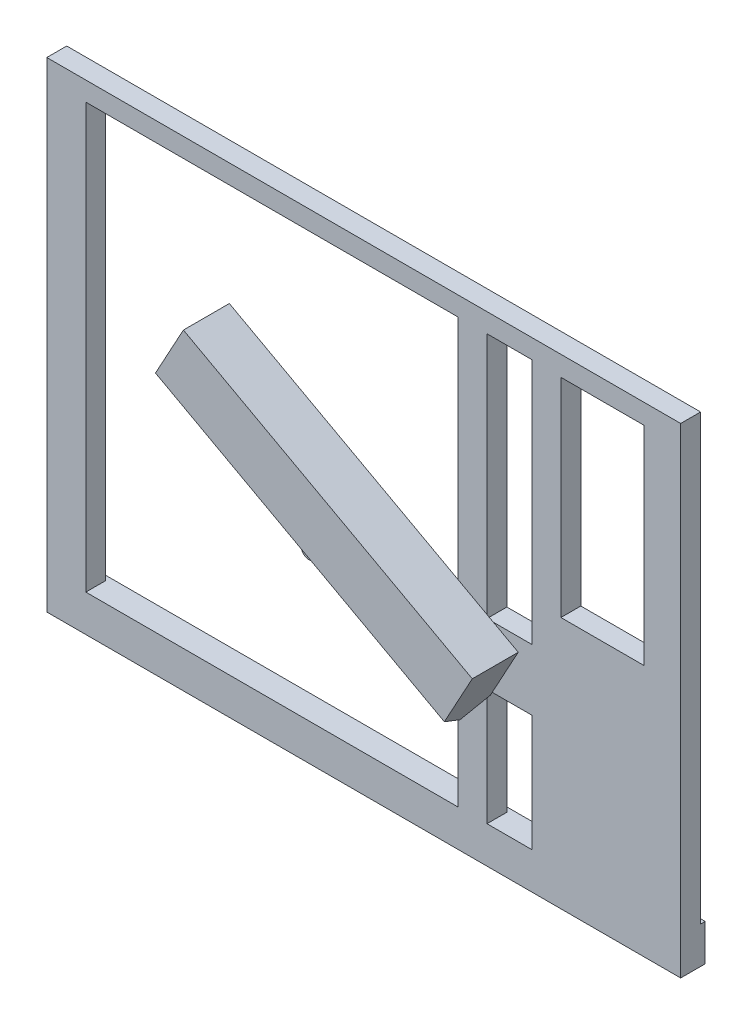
from build123d import *

# Parameters (mm, degrees)
SKETCH1_W                = 1542.262809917
SKETCH1_H                = 1758.95
SKETCH1_W_2              = 185.7375
SKETCH1_H_2              = 1022.35
SKETCH1_H_3              = 482.6
SKETCH1_W_3              = 344.107024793
SKETCH1_H_4              = 862.340495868
BOSS_EXTRUDE1_DEPTH      = 82.55
SKETCH2_W                = 2627.496177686
SKETCH2_H                = 101.6
BOSS_EXTRUDE2_DEPTH      = 152.4
BOSS_EXTRUDE3_DEPTH      = 190.5
BOSS_EXTRUDE4_DEPTH      = 6.35
BOSS_EXTRUDE4_DEPTH_BACK = 6.35
SKETCH5_R                = 19.05


with BuildPart() as part:
    # Sketch1 → Boss-Extrude1 (new body)
    with BuildSketch(Plane.XY):
        Polygon((-1703.951652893, -152.4), (688.214049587, -152.4), (923.544524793, -152.4), (923.544524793, 1838.325), (-1703.951652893, 1838.325), align=None)
        with Locations((-771.131404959, 879.475)):
            Rectangle(SKETCH1_W, SKETCH1_H, mode=Mode.SUBTRACT)
        with Locations((213.51875, 1247.775)):
            Rectangle(SKETCH1_W_2, SKETCH1_H_2, mode=Mode.SUBTRACT)
        with Locations((213.51875, 241.3)):
            Rectangle(SKETCH1_W_2, SKETCH1_H_3, mode=Mode.SUBTRACT)
        with Locations((599.091012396, 1324.604752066)):
            Rectangle(SKETCH1_W_3, SKETCH1_H_4, mode=Mode.SUBTRACT)
    extrude(amount=BOSS_EXTRUDE1_DEPTH)

    # Sketch2 → Boss-Extrude2 (add)
    with BuildSketch(Plane(origin=(0, 0, 0), x_dir=(1, 0, 0), z_dir=(0, 1, 0))):
        with Locations((-390.20356405, -31.75)):
            Rectangle(SKETCH2_W, SKETCH2_H)
    extrude(amount=-BOSS_EXTRUDE2_DEPTH)


with BuildPart() as body_2:
    # Sketch3 → Boss-Extrude3 (new body)
    with BuildSketch(Plane(origin=(0, 0, 508), x_dir=(-1, 0, 0), z_dir=(0, 0, -1))):
        Polygon((667.788384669, 1491.36625844), (-529.705942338, 838.2), (-675.657925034, 1105.78374156), (521.836401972, 1758.95), align=None)
    extrude(amount=-BOSS_EXTRUDE3_DEPTH)

    # Cut-Sweep3: sweep along a curve in space
    with BuildLine() as cut_sweep3_path:
        Line((529.705942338, 838.2, 698.5), (-667.788384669, 1491.36625844, 698.5))
    # Sketch4 → Cut-Sweep3 (sweep, cut)
    with BuildSketch(Plane(origin=(-1141.606737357, 622.682700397, 0), x_dir=(0, 0, 1), z_dir=(-0.8778994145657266, 0.4788450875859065, 0))):
        Polygon((508, 1052.684079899), (603.25, 989.502377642), (698.5, 1052.684079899), (698.5, 989.502377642), (698.5, 964.102377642), (508, 964.102377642), (508, 964.578099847), align=None)
    sweep(path=cut_sweep3_path.line, mode=Mode.SUBTRACT)


with BuildPart() as body_3:
    # Sketch5 → Boss-Extrude4 (new, two sides: drawn at the far end of the back side and taken through both)
    with BuildSketch(Plane.XY.offset(603.25).offset(-BOSS_EXTRUDE4_DEPTH_BACK)):
        with BuildLine():
            Line((-14.591016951, 1135.083584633), (-133.137507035, 1199.744072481))
            Line((-133.137507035, 1199.744072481), (-139.218839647, 1188.594749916))
            ThreePointArc((-139.218839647, 1188.594749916), (-139.957354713, 1186.152653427), (-139.657813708, 1183.618977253))
            Line((-139.657813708, 1183.618977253), (-120.992274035, 1127.919433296))
            ThreePointArc((-120.992274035, 1127.919433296), (-105.494955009, 1109.423117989), (-81.553596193, 1106.40783774))
            Line((-81.553596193, 1106.40783774), (-24.618091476, 1120.871235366))
            ThreePointArc((-24.618091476, 1120.871235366), (-22.32571301, 1121.991164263), (-20.672349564, 1123.934262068))
            Line((-20.672349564, 1123.934262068), (-14.591016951, 1135.083584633))
        make_face()
        with Locations((-89.683490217, 1138.411356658)):
            Circle(SKETCH5_R, mode=Mode.SUBTRACT)
    extrude(amount=BOSS_EXTRUDE4_DEPTH + BOSS_EXTRUDE4_DEPTH_BACK)


solid = Compound([part.part, body_2.part, body_3.part])
